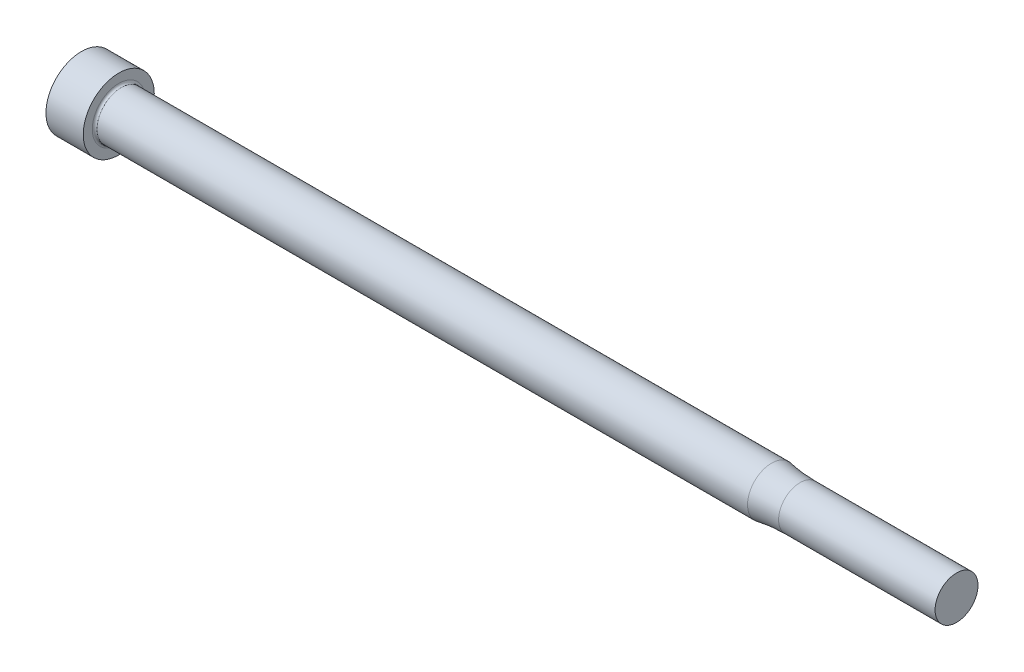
ISO-10303-21;
HEADER;
FILE_DESCRIPTION(('STEP AP214'),'2;1');
FILE_NAME('part.step','',(''),(''),'','','');
FILE_SCHEMA(('AUTOMOTIVE_DESIGN { 1 0 10303 214 1 1 1 1 }'));
ENDSEC;
DATA;
#1=APPLICATION_CONTEXT('core data for automotive mechanical design processes');
#2=APPLICATION_PROTOCOL_DEFINITION('international standard','automotive_design',2000,#1);
#3=PRODUCT_CONTEXT('',#1,'mechanical');
#4=PRODUCT('Part','Part','',(#3));
#5=PRODUCT_RELATED_PRODUCT_CATEGORY('part','',(#4));
#6=PRODUCT_DEFINITION_FORMATION('','',#4);
#7=PRODUCT_DEFINITION_CONTEXT('part definition',#1,'design');
#8=PRODUCT_DEFINITION('design','',#6,#7);
#9=PRODUCT_DEFINITION_SHAPE('','',#8);
#10=(LENGTH_UNIT() NAMED_UNIT(*) SI_UNIT(.MILLI.,.METRE.));
#11=(NAMED_UNIT(*) PLANE_ANGLE_UNIT() SI_UNIT($,.RADIAN.));
#12=(NAMED_UNIT(*) SI_UNIT($,.STERADIAN.) SOLID_ANGLE_UNIT());
#13=UNCERTAINTY_MEASURE_WITH_UNIT(LENGTH_MEASURE(1.E-05),#10,'distance_accuracy_value','');
#14=(GEOMETRIC_REPRESENTATION_CONTEXT(3) GLOBAL_UNCERTAINTY_ASSIGNED_CONTEXT((#13)) GLOBAL_UNIT_ASSIGNED_CONTEXT((#10,
#11,#12)) REPRESENTATION_CONTEXT('',''));
#15=CARTESIAN_POINT('',(0.,0.,0.));
#16=DIRECTION('',(0.,0.,1.));
#17=DIRECTION('',(1.,0.,0.));
#18=AXIS2_PLACEMENT_3D('',#15,#16,#17);
#19=CARTESIAN_POINT('',(0.,1.475,0.));
#20=DIRECTION('',(-1.,0.,0.));
#21=DIRECTION('',(0.,0.,1.));
#22=AXIS2_PLACEMENT_3D('',#19,#20,#21);
#23=PLANE('',#22);
#24=CARTESIAN_POINT('',(0.,0.,0.));
#25=DIRECTION('',(1.,0.,0.));
#26=DIRECTION('',(0.,0.,-1.));
#27=AXIS2_PLACEMENT_3D('',#24,#25,#26);
#28=CIRCLE('',#27,2.95);
#29=CARTESIAN_POINT('',(0.,0.,-2.95));
#30=VERTEX_POINT('',#29);
#31=EDGE_CURVE('E18',#30,#30,#28,.T.);
#32=ORIENTED_EDGE('',*,*,#31,.F.);
#33=EDGE_LOOP('',(#32));
#34=FACE_BOUND('',#33,.T.);
#35=ADVANCED_FACE('F15',(#34),#23,.T.);
#36=CARTESIAN_POINT('',(72.7,0.8915,0.));
#37=DIRECTION('',(1.,0.,0.));
#38=DIRECTION('',(0.,0.,-1.));
#39=AXIS2_PLACEMENT_3D('',#36,#37,#38);
#40=PLANE('',#39);
#41=CARTESIAN_POINT('',(72.7,0.,0.));
#42=DIRECTION('',(1.,0.,0.));
#43=DIRECTION('',(0.,0.,-1.));
#44=AXIS2_PLACEMENT_3D('',#41,#42,#43);
#45=CIRCLE('',#44,1.783);
#46=CARTESIAN_POINT('',(72.7,0.,-1.783));
#47=VERTEX_POINT('',#46);
#48=EDGE_CURVE('E63',#47,#47,#45,.F.);
#49=ORIENTED_EDGE('',*,*,#48,.F.);
#50=EDGE_LOOP('',(#49));
#51=FACE_BOUND('',#50,.T.);
#52=ADVANCED_FACE('F74',(#51),#40,.T.);
#53=CARTESIAN_POINT('',(1.55,0.,0.));
#54=DIRECTION('',(1.,0.,0.));
#55=DIRECTION('',(0.,0.,-1.));
#56=AXIS2_PLACEMENT_3D('',#53,#54,#55);
#57=CYLINDRICAL_SURFACE('',#56,2.95);
#58=ORIENTED_EDGE('',*,*,#31,.T.);
#59=EDGE_LOOP('',(#58));
#60=FACE_BOUND('',#59,.T.);
#61=CARTESIAN_POINT('',(3.1,0.,0.));
#62=DIRECTION('',(1.,0.,0.));
#63=DIRECTION('',(0.,0.,-1.));
#64=AXIS2_PLACEMENT_3D('',#61,#62,#63);
#65=CIRCLE('',#64,2.95);
#66=CARTESIAN_POINT('',(3.1,0.,-2.95));
#67=VERTEX_POINT('',#66);
#68=EDGE_CURVE('E55',#67,#67,#65,.T.);
#69=ORIENTED_EDGE('',*,*,#68,.F.);
#70=EDGE_LOOP('',(#69));
#71=FACE_BOUND('',#70,.T.);
#72=ADVANCED_FACE('F70',(#60,#71),#57,.T.);
#73=CARTESIAN_POINT('',(66.2,0.,0.));
#74=DIRECTION('',(1.,0.,0.));
#75=DIRECTION('',(0.,0.,-1.));
#76=AXIS2_PLACEMENT_3D('',#73,#74,#75);
#77=CYLINDRICAL_SURFACE('',#76,1.783);
#78=CARTESIAN_POINT('',(59.7,0.,0.));
#79=DIRECTION('',(1.,0.,0.));
#80=DIRECTION('',(0.,0.,-1.));
#81=AXIS2_PLACEMENT_3D('',#78,#79,#80);
#82=CIRCLE('',#81,1.783);
#83=CARTESIAN_POINT('',(59.7,0.,-1.783));
#84=VERTEX_POINT('',#83);
#85=EDGE_CURVE('E62',#84,#84,#82,.T.);
#86=ORIENTED_EDGE('',*,*,#85,.T.);
#87=EDGE_LOOP('',(#86));
#88=FACE_BOUND('',#87,.T.);
#89=ORIENTED_EDGE('',*,*,#48,.T.);
#90=EDGE_LOOP('',(#89));
#91=FACE_BOUND('',#90,.T.);
#92=ADVANCED_FACE('F107',(#88,#91),#77,.T.);
#93=CARTESIAN_POINT('',(3.1,2.575,0.));
#94=DIRECTION('',(1.,0.,0.));
#95=DIRECTION('',(0.,0.,-1.));
#96=AXIS2_PLACEMENT_3D('',#93,#94,#95);
#97=PLANE('',#96);
#98=CARTESIAN_POINT('',(3.1,0.,0.));
#99=DIRECTION('',(1.,0.,0.));
#100=DIRECTION('',(0.,1.,0.));
#101=AXIS2_PLACEMENT_3D('',#98,#99,#100);
#102=CIRCLE('',#101,2.2);
#103=CARTESIAN_POINT('',(3.1,2.2,0.));
#104=VERTEX_POINT('',#103);
#105=EDGE_CURVE('E27',#104,#104,#102,.F.);
#106=ORIENTED_EDGE('',*,*,#105,.T.);
#107=EDGE_LOOP('',(#106));
#108=FACE_BOUND('',#107,.T.);
#109=ORIENTED_EDGE('',*,*,#68,.T.);
#110=EDGE_LOOP('',(#109));
#111=FACE_BOUND('',#110,.T.);
#112=ADVANCED_FACE('F88',(#108,#111),#97,.T.);
#113=CARTESIAN_POINT('',(59.7,0.,0.));
#114=DIRECTION('',(1.,0.,0.));
#115=DIRECTION('',(0.,0.,-1.));
#116=AXIS2_PLACEMENT_3D('',#113,#114,#115);
#117=TOROIDAL_SURFACE('',#116,14.783,13.);
#118=CARTESIAN_POINT('',(57.3346435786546,0.,0.));
#119=DIRECTION('',(1.,0.,0.));
#120=DIRECTION('',(0.,0.,-1.));
#121=AXIS2_PLACEMENT_3D('',#118,#119,#120);
#122=CIRCLE('',#121,2.);
#123=CARTESIAN_POINT('',(57.3346435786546,0.,-2.));
#124=VERTEX_POINT('',#123);
#125=EDGE_CURVE('E22',#124,#124,#122,.F.);
#126=ORIENTED_EDGE('',*,*,#125,.F.);
#127=EDGE_LOOP('',(#126));
#128=FACE_BOUND('',#127,.T.);
#129=ORIENTED_EDGE('',*,*,#85,.F.);
#130=EDGE_LOOP('',(#129));
#131=FACE_BOUND('',#130,.T.);
#132=ADVANCED_FACE('F45',(#128,#131),#117,.F.);
#133=CARTESIAN_POINT('',(3.3,0.,0.));
#134=DIRECTION('',(1.,0.,0.));
#135=DIRECTION('',(0.,0.,-1.));
#136=AXIS2_PLACEMENT_3D('',#133,#134,#135);
#137=TOROIDAL_SURFACE('',#136,2.2,0.2);
#138=ORIENTED_EDGE('',*,*,#105,.F.);
#139=EDGE_LOOP('',(#138));
#140=FACE_BOUND('',#139,.T.);
#141=CARTESIAN_POINT('',(3.3,0.,0.));
#142=DIRECTION('',(1.,0.,0.));
#143=DIRECTION('',(0.,0.,-1.));
#144=AXIS2_PLACEMENT_3D('',#141,#142,#143);
#145=CIRCLE('',#144,2.);
#146=CARTESIAN_POINT('',(3.3,0.,-2.));
#147=VERTEX_POINT('',#146);
#148=EDGE_CURVE('E10',#147,#147,#145,.T.);
#149=ORIENTED_EDGE('',*,*,#148,.F.);
#150=EDGE_LOOP('',(#149));
#151=FACE_BOUND('',#150,.T.);
#152=ADVANCED_FACE('F39',(#140,#151),#137,.F.);
#153=CARTESIAN_POINT('',(30.3173217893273,0.,0.));
#154=DIRECTION('',(1.,0.,0.));
#155=DIRECTION('',(0.,0.,-1.));
#156=AXIS2_PLACEMENT_3D('',#153,#154,#155);
#157=CYLINDRICAL_SURFACE('',#156,2.);
#158=ORIENTED_EDGE('',*,*,#148,.T.);
#159=EDGE_LOOP('',(#158));
#160=FACE_BOUND('',#159,.T.);
#161=ORIENTED_EDGE('',*,*,#125,.T.);
#162=EDGE_LOOP('',(#161));
#163=FACE_BOUND('',#162,.T.);
#164=ADVANCED_FACE('F44',(#160,#163),#157,.T.);
#165=CLOSED_SHELL('',(#35,#52,#72,#92,#112,#132,#152,#164));
#166=MANIFOLD_SOLID_BREP('B1',#165);
#167=ADVANCED_BREP_SHAPE_REPRESENTATION('',(#18,#166),#14);
#168=SHAPE_DEFINITION_REPRESENTATION(#9,#167);
ENDSEC;
END-ISO-10303-21;
